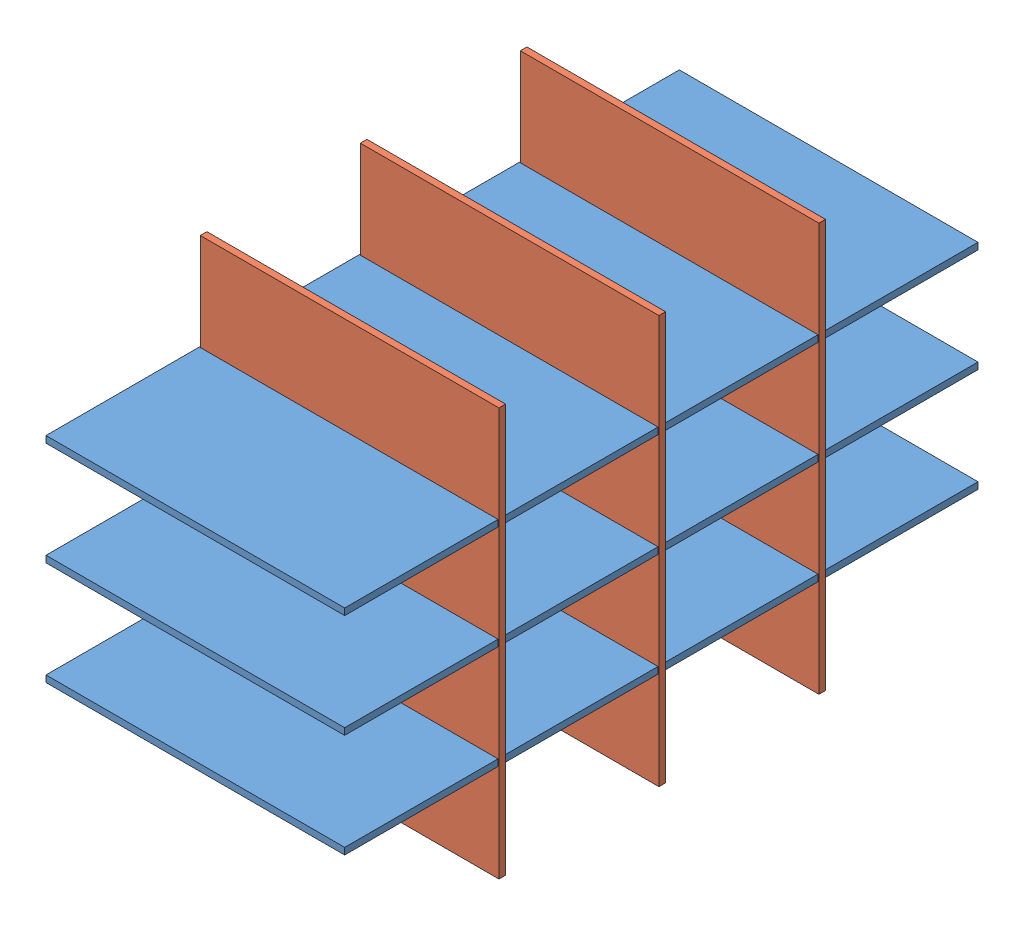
SolidWorks assembly Assem1.sldasm, configuration Default (file format 9000). Lengths in mm.
Overall size (160.78 218.95 339.85).
6 component instances, 2 part files, 3 mates.
Components (placement in the parent):
- Part1-1: Part1.SLDPRT [Default] at (-17.2591 231.8806 248.3741) x (1 0 0) z (0 -1 0) size (160.27 339.85 3.56)
- Part2-1: Part2.SLDPRT [Default] at (143.5229 395.2026 505.9301) x (0 -1 0) z (0 0 -1) size (218.95 160.27 3.56)
- Part2-9: Part2.SLDPRT [Default] at (143.5229 395.2026 420.0781) x (0 -1 0) z (0 0 -1) size (218.95 160.27 3.56)
- Part2-10: Part2.SLDPRT [Default] at (143.5229 395.2026 334.2261) x (0 -1 0) z (0 0 -1) size (218.95 160.27 3.56)
- Part1-6: Part1.SLDPRT [Default] at (-17.2591 287.5066 248.3741) x (1 0 0) z (0 -1 0) size (160.27 339.85 3.56)
- Part1-7: Part1.SLDPRT [Default] at (-17.2591 343.1326 248.3741) x (1 0 0) z (0 -1 0) size (160.27 339.85 3.56)
Mates (geometry in assembly coordinates):
- Coincident12: coincident anti-aligned: plane of Part1-1 through (63.2589 228.3246 502.3741) normal (1 0 0); plane of Part2-1 through (63.2589 231.8806 502.3741) normal (-1 0 0)
- Coincident13: coincident anti-aligned: plane of Part2-1 through (143.5229 395.2026 505.9301) normal (0 0 1); plane of Part1-1 through (63.2589 228.3246 505.9301) normal (0 0 -1)
- Coincident15: coincident anti-aligned: plane of Part1-1 through (-17.2591 228.3246 248.3741) normal (0 -1 0); plane of Part2-1 through (63.2589 228.3246 502.3741) normal (0 1 0)
